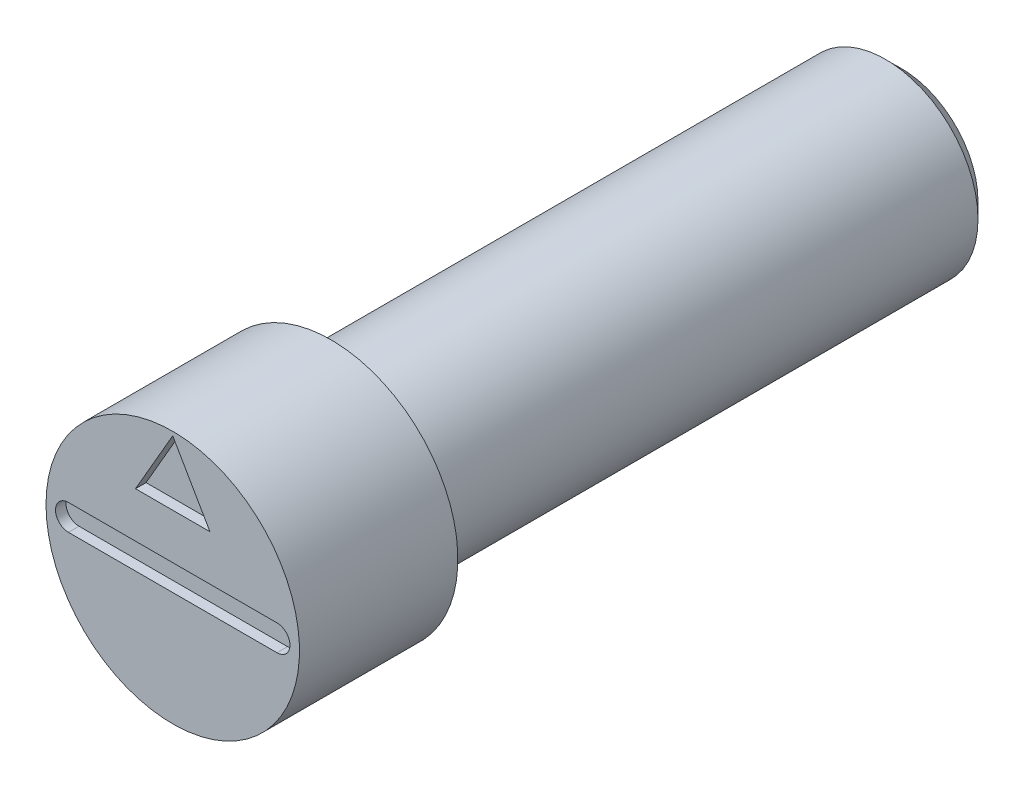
ISO-10303-21;
HEADER;
FILE_DESCRIPTION(('STEP AP214'),'2;1');
FILE_NAME('part.step','',(''),(''),'','','');
FILE_SCHEMA(('AUTOMOTIVE_DESIGN { 1 0 10303 214 1 1 1 1 }'));
ENDSEC;
DATA;
#1=APPLICATION_CONTEXT('core data for automotive mechanical design processes');
#2=APPLICATION_PROTOCOL_DEFINITION('international standard','automotive_design',2000,#1);
#3=PRODUCT_CONTEXT('',#1,'mechanical');
#4=PRODUCT('Part','Part','',(#3));
#5=PRODUCT_RELATED_PRODUCT_CATEGORY('part','',(#4));
#6=PRODUCT_DEFINITION_FORMATION('','',#4);
#7=PRODUCT_DEFINITION_CONTEXT('part definition',#1,'design');
#8=PRODUCT_DEFINITION('design','',#6,#7);
#9=PRODUCT_DEFINITION_SHAPE('','',#8);
#10=(LENGTH_UNIT() NAMED_UNIT(*) SI_UNIT(.MILLI.,.METRE.));
#11=(NAMED_UNIT(*) PLANE_ANGLE_UNIT() SI_UNIT($,.RADIAN.));
#12=(NAMED_UNIT(*) SI_UNIT($,.STERADIAN.) SOLID_ANGLE_UNIT());
#13=UNCERTAINTY_MEASURE_WITH_UNIT(LENGTH_MEASURE(1.E-05),#10,'distance_accuracy_value','');
#14=(GEOMETRIC_REPRESENTATION_CONTEXT(3) GLOBAL_UNCERTAINTY_ASSIGNED_CONTEXT((#13)) GLOBAL_UNIT_ASSIGNED_CONTEXT((#10,
#11,#12)) REPRESENTATION_CONTEXT('',''));
#15=CARTESIAN_POINT('',(0.,0.,0.));
#16=DIRECTION('',(0.,0.,1.));
#17=DIRECTION('',(1.,0.,0.));
#18=AXIS2_PLACEMENT_3D('',#15,#16,#17);
#19=CARTESIAN_POINT('',(1.1999976,0.,0.));
#20=DIRECTION('',(0.,0.,1.));
#21=DIRECTION('',(1.,0.,0.));
#22=AXIS2_PLACEMENT_3D('',#19,#20,#21);
#23=PLANE('',#22);
#24=CARTESIAN_POINT('',(-1.975,0.,0.));
#25=DIRECTION('',(0.,0.,1.));
#26=DIRECTION('',(1.,0.,0.));
#27=AXIS2_PLACEMENT_3D('',#24,#25,#26);
#28=CIRCLE('',#27,0.245);
#29=CARTESIAN_POINT('',(-1.975,0.245,0.));
#30=VERTEX_POINT('',#29);
#31=CARTESIAN_POINT('',(-1.975,-0.245,0.));
#32=VERTEX_POINT('',#31);
#33=EDGE_CURVE('E56',#30,#32,#28,.T.);
#34=ORIENTED_EDGE('',*,*,#33,.F.);
#35=DIRECTION('',(-1.,0.,0.));
#36=VECTOR('',#35,1.);
#37=CARTESIAN_POINT('',(-1.975,0.245,0.));
#38=LINE('',#37,#36);
#39=CARTESIAN_POINT('',(1.975,0.245,0.));
#40=VERTEX_POINT('',#39);
#41=EDGE_CURVE('E120',#40,#30,#38,.T.);
#42=ORIENTED_EDGE('',*,*,#41,.F.);
#43=CARTESIAN_POINT('',(1.975,0.,0.));
#44=DIRECTION('',(0.,0.,1.));
#45=DIRECTION('',(1.,0.,0.));
#46=AXIS2_PLACEMENT_3D('',#43,#44,#45);
#47=CIRCLE('',#46,0.245);
#48=CARTESIAN_POINT('',(1.975,-0.245,0.));
#49=VERTEX_POINT('',#48);
#50=EDGE_CURVE('E123',#49,#40,#47,.T.);
#51=ORIENTED_EDGE('',*,*,#50,.F.);
#52=DIRECTION('',(1.,0.,0.));
#53=VECTOR('',#52,1.);
#54=CARTESIAN_POINT('',(-1.975,-0.245,0.));
#55=LINE('',#54,#53);
#56=EDGE_CURVE('E129',#32,#49,#55,.T.);
#57=ORIENTED_EDGE('',*,*,#56,.F.);
#58=EDGE_LOOP('',(#34,#42,#51,#57));
#59=FACE_BOUND('',#58,.T.);
#60=DIRECTION('',(-0.499999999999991,0.866025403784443,0.));
#61=VECTOR('',#60,1.);
#62=CARTESIAN_POINT('',(0.704999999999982,1.105,0.));
#63=LINE('',#62,#61);
#64=CARTESIAN_POINT('',(0.704999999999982,1.105,0.));
#65=VERTEX_POINT('',#64);
#66=CARTESIAN_POINT('',(0.,2.32609581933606,0.));
#67=VERTEX_POINT('',#66);
#68=EDGE_CURVE('E64',#65,#67,#63,.T.);
#69=ORIENTED_EDGE('',*,*,#68,.F.);
#70=DIRECTION('',(1.,0.,0.));
#71=VECTOR('',#70,1.);
#72=CARTESIAN_POINT('',(-0.705000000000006,1.105,0.));
#73=LINE('',#72,#71);
#74=CARTESIAN_POINT('',(-0.705000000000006,1.105,0.));
#75=VERTEX_POINT('',#74);
#76=EDGE_CURVE('E142',#75,#65,#73,.T.);
#77=ORIENTED_EDGE('',*,*,#76,.F.);
#78=DIRECTION('',(-0.500000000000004,-0.866025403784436,0.));
#79=VECTOR('',#78,1.);
#80=CARTESIAN_POINT('',(0.,2.32609581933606,0.));
#81=LINE('',#80,#79);
#82=EDGE_CURVE('E150',#67,#75,#81,.T.);
#83=ORIENTED_EDGE('',*,*,#82,.F.);
#84=EDGE_LOOP('',(#69,#77,#83));
#85=FACE_BOUND('',#84,.T.);
#86=CARTESIAN_POINT('',(0.,0.,0.));
#87=DIRECTION('',(0.,0.,-1.));
#88=DIRECTION('',(-1.,0.,0.));
#89=AXIS2_PLACEMENT_3D('',#86,#87,#88);
#90=CIRCLE('',#89,2.3999952);
#91=CARTESIAN_POINT('',(-2.3999952,0.,0.));
#92=VERTEX_POINT('',#91);
#93=EDGE_CURVE('E157',#92,#92,#90,.T.);
#94=ORIENTED_EDGE('',*,*,#93,.F.);
#95=EDGE_LOOP('',(#94));
#96=FACE_BOUND('',#95,.T.);
#97=ADVANCED_FACE('F40',(#59,#85,#96),#23,.T.);
#98=CARTESIAN_POINT('',(0.,0.,-1.499997));
#99=DIRECTION('',(0.,0.,-1.));
#100=DIRECTION('',(-1.,0.,0.));
#101=AXIS2_PLACEMENT_3D('',#98,#99,#100);
#102=CYLINDRICAL_SURFACE('',#101,2.3999952);
#103=ORIENTED_EDGE('',*,*,#93,.T.);
#104=EDGE_LOOP('',(#103));
#105=FACE_BOUND('',#104,.T.);
#106=CARTESIAN_POINT('',(0.,0.,-2.999994));
#107=DIRECTION('',(0.,0.,-1.));
#108=DIRECTION('',(-1.,0.,0.));
#109=AXIS2_PLACEMENT_3D('',#106,#107,#108);
#110=CIRCLE('',#109,2.3999952);
#111=CARTESIAN_POINT('',(-2.3999952,0.,-2.999994));
#112=VERTEX_POINT('',#111);
#113=EDGE_CURVE('E164',#112,#112,#110,.T.);
#114=ORIENTED_EDGE('',*,*,#113,.F.);
#115=EDGE_LOOP('',(#114));
#116=FACE_BOUND('',#115,.T.);
#117=ADVANCED_FACE('F192',(#105,#116),#102,.T.);
#118=CARTESIAN_POINT('',(2.07499585,0.,-2.999994));
#119=DIRECTION('',(0.,0.,-1.));
#120=DIRECTION('',(-1.,0.,0.));
#121=AXIS2_PLACEMENT_3D('',#118,#119,#120);
#122=PLANE('',#121);
#123=CARTESIAN_POINT('',(0.,0.,-2.999994));
#124=DIRECTION('',(0.,0.,-1.));
#125=DIRECTION('',(-1.,0.,0.));
#126=AXIS2_PLACEMENT_3D('',#123,#124,#125);
#127=CIRCLE('',#126,1.7499965);
#128=CARTESIAN_POINT('',(-1.74999649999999,0.,-2.999994));
#129=VERTEX_POINT('',#128);
#130=EDGE_CURVE('E161',#129,#129,#127,.T.);
#131=ORIENTED_EDGE('',*,*,#130,.F.);
#132=EDGE_LOOP('',(#131));
#133=FACE_BOUND('',#132,.T.);
#134=ORIENTED_EDGE('',*,*,#113,.T.);
#135=EDGE_LOOP('',(#134));
#136=FACE_BOUND('',#135,.T.);
#137=ADVANCED_FACE('F183',(#133,#136),#122,.T.);
#138=CARTESIAN_POINT('',(0.,0.,-10.499979));
#139=DIRECTION('',(0.,0.,-1.));
#140=DIRECTION('',(-1.,0.,0.));
#141=AXIS2_PLACEMENT_3D('',#138,#139,#140);
#142=CYLINDRICAL_SURFACE('',#141,1.7499965);
#143=CARTESIAN_POINT('',(0.,0.,-13.5));
#144=DIRECTION('',(0.,0.,1.));
#145=DIRECTION('',(1.,0.,0.));
#146=AXIS2_PLACEMENT_3D('',#143,#144,#145);
#147=CIRCLE('',#146,1.7499965);
#148=CARTESIAN_POINT('',(1.74999650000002,0.,-13.5));
#149=VERTEX_POINT('',#148);
#150=EDGE_CURVE('E12',#149,#149,#147,.T.);
#151=ORIENTED_EDGE('',*,*,#150,.T.);
#152=EDGE_LOOP('',(#151));
#153=FACE_BOUND('',#152,.T.);
#154=ORIENTED_EDGE('',*,*,#130,.T.);
#155=EDGE_LOOP('',(#154));
#156=FACE_BOUND('',#155,.T.);
#157=ADVANCED_FACE('F180',(#153,#156),#142,.T.);
#158=CARTESIAN_POINT('',(0.704999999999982,1.105,-0.2));
#159=DIRECTION('',(0.866025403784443,0.499999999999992,0.));
#160=DIRECTION('',(-0.499999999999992,0.866025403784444,0.));
#161=AXIS2_PLACEMENT_3D('',#158,#159,#160);
#162=PLANE('',#161);
#163=ORIENTED_EDGE('',*,*,#68,.T.);
#164=DIRECTION('',(0.,0.,1.));
#165=VECTOR('',#164,1.);
#166=CARTESIAN_POINT('',(0.,2.32609581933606,-0.2));
#167=LINE('',#166,#165);
#168=CARTESIAN_POINT('',(0.,2.32609581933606,-0.2));
#169=VERTEX_POINT('',#168);
#170=EDGE_CURVE('E148',#169,#67,#167,.T.);
#171=ORIENTED_EDGE('',*,*,#170,.F.);
#172=DIRECTION('',(-0.499999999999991,0.866025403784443,0.));
#173=VECTOR('',#172,1.);
#174=CARTESIAN_POINT('',(0.704999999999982,1.105,-0.2));
#175=LINE('',#174,#173);
#176=CARTESIAN_POINT('',(0.704999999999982,1.105,-0.2));
#177=VERTEX_POINT('',#176);
#178=EDGE_CURVE('E138',#177,#169,#175,.T.);
#179=ORIENTED_EDGE('',*,*,#178,.F.);
#180=DIRECTION('',(0.,0.,1.));
#181=VECTOR('',#180,1.);
#182=CARTESIAN_POINT('',(0.704999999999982,1.105,-0.2));
#183=LINE('',#182,#181);
#184=EDGE_CURVE('E155',#177,#65,#183,.T.);
#185=ORIENTED_EDGE('',*,*,#184,.T.);
#186=EDGE_LOOP('',(#163,#171,#179,#185));
#187=FACE_BOUND('',#186,.T.);
#188=ADVANCED_FACE('F182',(#187),#162,.F.);
#189=CARTESIAN_POINT('',(-0.705000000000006,1.105,-0.2));
#190=DIRECTION('',(0.,-1.,0.));
#191=DIRECTION('',(1.,0.,0.));
#192=AXIS2_PLACEMENT_3D('',#189,#190,#191);
#193=PLANE('',#192);
#194=ORIENTED_EDGE('',*,*,#76,.T.);
#195=ORIENTED_EDGE('',*,*,#184,.F.);
#196=DIRECTION('',(1.,0.,0.));
#197=VECTOR('',#196,1.);
#198=CARTESIAN_POINT('',(-0.705000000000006,1.105,-0.2));
#199=LINE('',#198,#197);
#200=CARTESIAN_POINT('',(-0.705000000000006,1.105,-0.2));
#201=VERTEX_POINT('',#200);
#202=EDGE_CURVE('E145',#201,#177,#199,.T.);
#203=ORIENTED_EDGE('',*,*,#202,.F.);
#204=DIRECTION('',(0.,0.,1.));
#205=VECTOR('',#204,1.);
#206=CARTESIAN_POINT('',(-0.705000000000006,1.105,-0.2));
#207=LINE('',#206,#205);
#208=EDGE_CURVE('E158',#201,#75,#207,.T.);
#209=ORIENTED_EDGE('',*,*,#208,.T.);
#210=EDGE_LOOP('',(#194,#195,#203,#209));
#211=FACE_BOUND('',#210,.T.);
#212=ADVANCED_FACE('F190',(#211),#193,.F.);
#213=CARTESIAN_POINT('',(0.,2.32609581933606,-0.2));
#214=DIRECTION('',(-0.866025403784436,0.500000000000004,0.));
#215=DIRECTION('',(-0.500000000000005,-0.866025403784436,0.));
#216=AXIS2_PLACEMENT_3D('',#213,#214,#215);
#217=PLANE('',#216);
#218=ORIENTED_EDGE('',*,*,#82,.T.);
#219=ORIENTED_EDGE('',*,*,#208,.F.);
#220=DIRECTION('',(-0.500000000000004,-0.866025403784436,0.));
#221=VECTOR('',#220,1.);
#222=CARTESIAN_POINT('',(0.,2.32609581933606,-0.2));
#223=LINE('',#222,#221);
#224=EDGE_CURVE('E141',#169,#201,#223,.T.);
#225=ORIENTED_EDGE('',*,*,#224,.F.);
#226=ORIENTED_EDGE('',*,*,#170,.T.);
#227=EDGE_LOOP('',(#218,#219,#225,#226));
#228=FACE_BOUND('',#227,.T.);
#229=ADVANCED_FACE('F214',(#228),#217,.F.);
#230=CARTESIAN_POINT('',(0.,0.,-0.2));
#231=DIRECTION('',(0.,0.,1.));
#232=DIRECTION('',(1.,0.,0.));
#233=AXIS2_PLACEMENT_3D('',#230,#231,#232);
#234=PLANE('',#233);
#235=ORIENTED_EDGE('',*,*,#178,.T.);
#236=ORIENTED_EDGE('',*,*,#224,.T.);
#237=ORIENTED_EDGE('',*,*,#202,.T.);
#238=EDGE_LOOP('',(#235,#236,#237));
#239=FACE_BOUND('',#238,.T.);
#240=ADVANCED_FACE('F219',(#239),#234,.T.);
#241=CARTESIAN_POINT('',(-1.975,0.,-0.2));
#242=DIRECTION('',(0.,0.,1.));
#243=DIRECTION('',(1.,0.,0.));
#244=AXIS2_PLACEMENT_3D('',#241,#242,#243);
#245=CYLINDRICAL_SURFACE('',#244,0.245);
#246=ORIENTED_EDGE('',*,*,#33,.T.);
#247=DIRECTION('',(0.,0.,1.));
#248=VECTOR('',#247,1.);
#249=CARTESIAN_POINT('',(-1.975,-0.245,-0.2));
#250=LINE('',#249,#248);
#251=CARTESIAN_POINT('',(-1.975,-0.245,-0.2));
#252=VERTEX_POINT('',#251);
#253=EDGE_CURVE('E98',#252,#32,#250,.T.);
#254=ORIENTED_EDGE('',*,*,#253,.F.);
#255=CARTESIAN_POINT('',(-1.975,0.,-0.2));
#256=DIRECTION('',(0.,0.,1.));
#257=DIRECTION('',(1.,0.,0.));
#258=AXIS2_PLACEMENT_3D('',#255,#256,#257);
#259=CIRCLE('',#258,0.245);
#260=CARTESIAN_POINT('',(-1.975,0.245,-0.2));
#261=VERTEX_POINT('',#260);
#262=EDGE_CURVE('E102',#261,#252,#259,.T.);
#263=ORIENTED_EDGE('',*,*,#262,.F.);
#264=DIRECTION('',(0.,0.,1.));
#265=VECTOR('',#264,1.);
#266=CARTESIAN_POINT('',(-1.975,0.245,-0.2));
#267=LINE('',#266,#265);
#268=EDGE_CURVE('E133',#261,#30,#267,.T.);
#269=ORIENTED_EDGE('',*,*,#268,.T.);
#270=EDGE_LOOP('',(#246,#254,#263,#269));
#271=FACE_BOUND('',#270,.T.);
#272=ADVANCED_FACE('F100',(#271),#245,.F.);
#273=CARTESIAN_POINT('',(-1.975,0.245,-0.2));
#274=DIRECTION('',(0.,1.,0.));
#275=DIRECTION('',(0.,0.,1.));
#276=AXIS2_PLACEMENT_3D('',#273,#274,#275);
#277=PLANE('',#276);
#278=ORIENTED_EDGE('',*,*,#41,.T.);
#279=ORIENTED_EDGE('',*,*,#268,.F.);
#280=DIRECTION('',(-1.,0.,0.));
#281=VECTOR('',#280,1.);
#282=CARTESIAN_POINT('',(-1.975,0.245,-0.2));
#283=LINE('',#282,#281);
#284=CARTESIAN_POINT('',(1.975,0.245,-0.2));
#285=VERTEX_POINT('',#284);
#286=EDGE_CURVE('E108',#285,#261,#283,.T.);
#287=ORIENTED_EDGE('',*,*,#286,.F.);
#288=DIRECTION('',(0.,0.,1.));
#289=VECTOR('',#288,1.);
#290=CARTESIAN_POINT('',(1.975,0.245,-0.2));
#291=LINE('',#290,#289);
#292=EDGE_CURVE('E135',#285,#40,#291,.T.);
#293=ORIENTED_EDGE('',*,*,#292,.T.);
#294=EDGE_LOOP('',(#278,#279,#287,#293));
#295=FACE_BOUND('',#294,.T.);
#296=ADVANCED_FACE('F231',(#295),#277,.F.);
#297=CARTESIAN_POINT('',(1.975,0.,-0.2));
#298=DIRECTION('',(0.,0.,1.));
#299=DIRECTION('',(1.,0.,0.));
#300=AXIS2_PLACEMENT_3D('',#297,#298,#299);
#301=CYLINDRICAL_SURFACE('',#300,0.245);
#302=ORIENTED_EDGE('',*,*,#50,.T.);
#303=ORIENTED_EDGE('',*,*,#292,.F.);
#304=CARTESIAN_POINT('',(1.975,0.,-0.2));
#305=DIRECTION('',(0.,0.,1.));
#306=DIRECTION('',(1.,0.,0.));
#307=AXIS2_PLACEMENT_3D('',#304,#305,#306);
#308=CIRCLE('',#307,0.245);
#309=CARTESIAN_POINT('',(1.975,-0.245,-0.2));
#310=VERTEX_POINT('',#309);
#311=EDGE_CURVE('E116',#310,#285,#308,.T.);
#312=ORIENTED_EDGE('',*,*,#311,.F.);
#313=DIRECTION('',(0.,0.,1.));
#314=VECTOR('',#313,1.);
#315=CARTESIAN_POINT('',(1.975,-0.245,-0.2));
#316=LINE('',#315,#314);
#317=EDGE_CURVE('E107',#310,#49,#316,.T.);
#318=ORIENTED_EDGE('',*,*,#317,.T.);
#319=EDGE_LOOP('',(#302,#303,#312,#318));
#320=FACE_BOUND('',#319,.T.);
#321=ADVANCED_FACE('F234',(#320),#301,.F.);
#322=CARTESIAN_POINT('',(-1.975,-0.245,-0.2));
#323=DIRECTION('',(0.,-1.,0.));
#324=DIRECTION('',(0.,0.,-1.));
#325=AXIS2_PLACEMENT_3D('',#322,#323,#324);
#326=PLANE('',#325);
#327=ORIENTED_EDGE('',*,*,#56,.T.);
#328=ORIENTED_EDGE('',*,*,#317,.F.);
#329=DIRECTION('',(1.,0.,0.));
#330=VECTOR('',#329,1.);
#331=CARTESIAN_POINT('',(-1.975,-0.245,-0.2));
#332=LINE('',#331,#330);
#333=EDGE_CURVE('E111',#252,#310,#332,.T.);
#334=ORIENTED_EDGE('',*,*,#333,.F.);
#335=ORIENTED_EDGE('',*,*,#253,.T.);
#336=EDGE_LOOP('',(#327,#328,#334,#335));
#337=FACE_BOUND('',#336,.T.);
#338=ADVANCED_FACE('F112',(#337),#326,.F.);
#339=CARTESIAN_POINT('',(-1.975,0.,-0.2));
#340=DIRECTION('',(0.,0.,1.));
#341=DIRECTION('',(1.,0.,0.));
#342=AXIS2_PLACEMENT_3D('',#339,#340,#341);
#343=PLANE('',#342);
#344=ORIENTED_EDGE('',*,*,#262,.T.);
#345=ORIENTED_EDGE('',*,*,#333,.T.);
#346=ORIENTED_EDGE('',*,*,#311,.T.);
#347=ORIENTED_EDGE('',*,*,#286,.T.);
#348=EDGE_LOOP('',(#344,#345,#346,#347));
#349=FACE_BOUND('',#348,.T.);
#350=ADVANCED_FACE('F118',(#349),#343,.T.);
#351=CARTESIAN_POINT('',(1.1999976,0.,-13.8));
#352=DIRECTION('',(0.,0.,1.));
#353=DIRECTION('',(1.,0.,0.));
#354=AXIS2_PLACEMENT_3D('',#351,#352,#353);
#355=PLANE('',#354);
#356=CARTESIAN_POINT('',(0.,0.,-13.8));
#357=DIRECTION('',(0.,0.,1.));
#358=DIRECTION('',(1.,0.,0.));
#359=AXIS2_PLACEMENT_3D('',#356,#357,#358);
#360=CIRCLE('',#359,1.4499965);
#361=CARTESIAN_POINT('',(1.44999650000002,0.,-13.8));
#362=VERTEX_POINT('',#361);
#363=EDGE_CURVE('E49',#362,#362,#360,.F.);
#364=ORIENTED_EDGE('',*,*,#363,.T.);
#365=EDGE_LOOP('',(#364));
#366=FACE_BOUND('',#365,.T.);
#367=ADVANCED_FACE('F171',(#366),#355,.F.);
#368=CARTESIAN_POINT('',(0.,0.,-13.8));
#369=DIRECTION('',(0.,0.,1.));
#370=DIRECTION('',(1.,0.,0.));
#371=AXIS2_PLACEMENT_3D('',#368,#369,#370);
#372=CONICAL_SURFACE('',#371,1.4499965,0.785398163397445);
#373=ORIENTED_EDGE('',*,*,#150,.F.);
#374=EDGE_LOOP('',(#373));
#375=FACE_BOUND('',#374,.T.);
#376=ORIENTED_EDGE('',*,*,#363,.F.);
#377=EDGE_LOOP('',(#376));
#378=FACE_BOUND('',#377,.T.);
#379=ADVANCED_FACE('F43',(#375,#378),#372,.T.);
#380=CLOSED_SHELL('',(#97,#117,#137,#157,#188,#212,#229,#240,#272,#296,#321,#338,#350,#367,#379));
#381=MANIFOLD_SOLID_BREP('B2',#380);
#382=ADVANCED_BREP_SHAPE_REPRESENTATION('',(#18,#381),#14);
#383=SHAPE_DEFINITION_REPRESENTATION(#9,#382);
ENDSEC;
END-ISO-10303-21;
